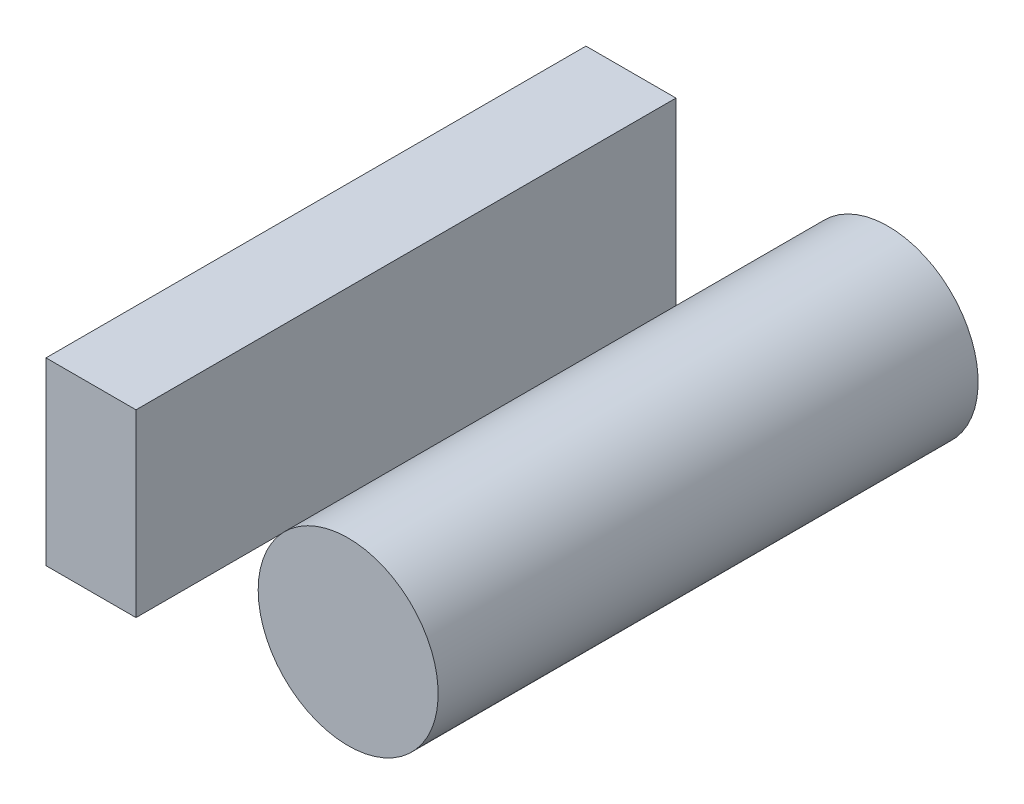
from build123d import *

# Parameters (mm, degrees)
SKIZZE1_W               = 10
SKIZZE1_H               = 20
LINEAR_AUSTRAGEN1_DEPTH = 60
SKIZZE2_R               = 10
LINEAR_AUSTRAGEN2_DEPTH = 60


with BuildPart() as part:
    # Skizze1 → Linear austragen1 (new body)
    with BuildSketch(Plane.XY):
        with Locations((-73.710029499, 16.992182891)):
            Rectangle(SKIZZE1_W, SKIZZE1_H)
    extrude(amount=LINEAR_AUSTRAGEN1_DEPTH)


with BuildPart() as body_2:
    # Skizze2 → Linear austragen2 (new body)
    with BuildSketch(Plane.XY):
        with Locations(Location((-45.13445309, 16.448639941, 0), (0, 0, 180))):
            Circle(SKIZZE2_R)
    extrude(amount=LINEAR_AUSTRAGEN2_DEPTH)


solid = Compound([part.part, body_2.part])
